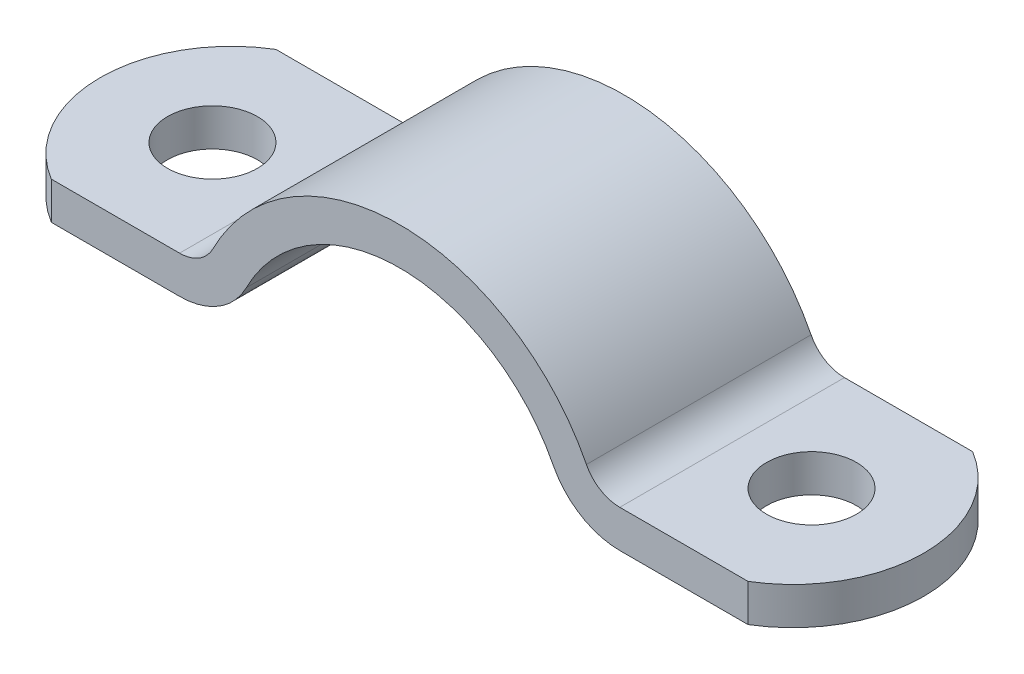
from build123d import *

# Parameters (mm, degrees)
EXTRUSION1_DEPTH = 15
CONG_1_R         = 10
CONG_2_R         = 5
EXTRUSION2_DEPTH = 66.984846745
ESQUISSE3_R      = 6
EXTRUSION3_DEPTH = 60.782940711


with BuildPart() as part:
    # Esquisse1 → Extrusion1 (new, symmetric)
    with BuildSketch(Plane.XY):
        with BuildLine():
            Line((22.449944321, 0), (60, 0))
            Line((60, 0), (60, 5))
            Line((60, 5), (26.153393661, 5))
            ThreePointArc((26.153393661, 5), (0, 23), (-26.153393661, 5))
            Line((-26.153393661, 5), (-60, 5))
            Line((-60, 5), (-60, 0))
            Line((-60, 0), (-22.449944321, 0))
            ThreePointArc((-22.449944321, 0), (0, 18), (22.449944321, 0))
        make_face()
    extrude(amount=EXTRUSION1_DEPTH, both=True)

    # Cong_1
    cong_1_edges = [part.edges().sort_by_distance(p)[0] for p in [
        (-22.449944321, 0, 0),
        (22.449944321, 0, 0),
    ]]
    fillet(cong_1_edges, radius=CONG_1_R)

    # Cong_2
    cong_2_edges = [part.edges().sort_by_distance(p)[0] for p in [
        (-26.153393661, 5, 0),
        (26.153393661, 5, 0),
    ]]
    fillet(cong_2_edges, radius=CONG_2_R)

    # Esquisse2 → Extrusion2 (cut, through all)
    with BuildSketch(Plane.XZ):
        with BuildLine():
            ThreePointArc((-46.513878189, 15), (-55, 0), (-46.513878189, -15))
            Line((-46.513878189, -15), (-60, -15))
            Line((-60, -15), (-60, 0))
            Line((-60, 0), (-60, 15))
            Line((-60, 15), (-46.513878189, 15))
        make_face()
        with BuildLine():
            Line((60, 0), (60, 15))
            Line((60, 15), (46.513878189, 15))
            ThreePointArc((46.513878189, 15), (55, 0), (46.513878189, -15))
            Line((46.513878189, -15), (60, -15))
            Line((60, -15), (60, 0))
        make_face()
    extrude(amount=-EXTRUSION2_DEPTH, mode=Mode.SUBTRACT)

    # Esquisse3 → Extrusion3 (cut, through all)
    with BuildSketch(Plane(origin=(0, 5, 0), x_dir=(1, 0, 0), z_dir=(0, 1, 0))):
        with Locations(Location((-40, 0, 0), (0, 0, 180))):
            Circle(ESQUISSE3_R)
        with Locations(Location((40, 0, 0), (0, 0, 180))):
            Circle(ESQUISSE3_R)
    extrude(amount=-EXTRUSION3_DEPTH, mode=Mode.SUBTRACT)


solid = part.part
